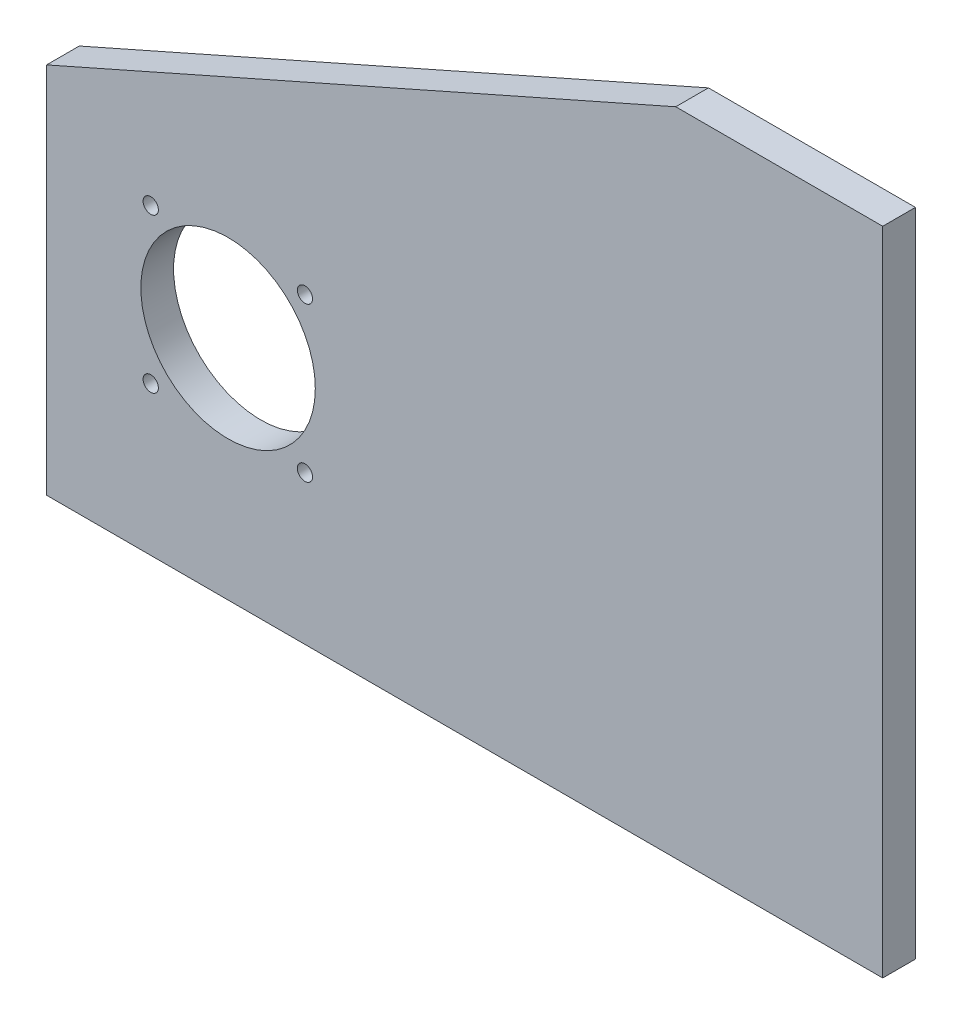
ISO-10303-21;
HEADER;
FILE_DESCRIPTION(('STEP AP214'),'2;1');
FILE_NAME('part.step','',(''),(''),'','','');
FILE_SCHEMA(('AUTOMOTIVE_DESIGN { 1 0 10303 214 1 1 1 1 }'));
ENDSEC;
DATA;
#1=APPLICATION_CONTEXT('core data for automotive mechanical design processes');
#2=APPLICATION_PROTOCOL_DEFINITION('international standard','automotive_design',2000,#1);
#3=PRODUCT_CONTEXT('',#1,'mechanical');
#4=PRODUCT('Part','Part','',(#3));
#5=PRODUCT_RELATED_PRODUCT_CATEGORY('part','',(#4));
#6=PRODUCT_DEFINITION_FORMATION('','',#4);
#7=PRODUCT_DEFINITION_CONTEXT('part definition',#1,'design');
#8=PRODUCT_DEFINITION('design','',#6,#7);
#9=PRODUCT_DEFINITION_SHAPE('','',#8);
#10=(LENGTH_UNIT() NAMED_UNIT(*) SI_UNIT(.MILLI.,.METRE.));
#11=(NAMED_UNIT(*) PLANE_ANGLE_UNIT() SI_UNIT($,.RADIAN.));
#12=(NAMED_UNIT(*) SI_UNIT($,.STERADIAN.) SOLID_ANGLE_UNIT());
#13=UNCERTAINTY_MEASURE_WITH_UNIT(LENGTH_MEASURE(1.E-05),#10,'distance_accuracy_value','');
#14=(GEOMETRIC_REPRESENTATION_CONTEXT(3) GLOBAL_UNCERTAINTY_ASSIGNED_CONTEXT((#13)) GLOBAL_UNIT_ASSIGNED_CONTEXT((#10,
#11,#12)) REPRESENTATION_CONTEXT('',''));
#15=CARTESIAN_POINT('',(0.,0.,0.));
#16=DIRECTION('',(0.,0.,1.));
#17=DIRECTION('',(1.,0.,0.));
#18=AXIS2_PLACEMENT_3D('',#15,#16,#17);
#19=CARTESIAN_POINT('',(-2757.22109900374,3423.79327060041,15.));
#20=DIRECTION('',(0.,0.,-1.));
#21=DIRECTION('',(-1.,0.,0.));
#22=AXIS2_PLACEMENT_3D('',#19,#20,#21);
#23=PLANE('',#22);
#24=CARTESIAN_POINT('',(-2638.72720889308,3562.73427177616,15.));
#25=DIRECTION('',(0.,0.,1.));
#26=DIRECTION('',(1.,0.,0.));
#27=AXIS2_PLACEMENT_3D('',#24,#25,#26);
#28=CIRCLE('',#27,3.47966760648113);
#29=CARTESIAN_POINT('',(-2635.2475412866,3562.73427177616,15.));
#30=VERTEX_POINT('',#29);
#31=EDGE_CURVE('E137',#30,#30,#28,.T.);
#32=ORIENTED_EDGE('',*,*,#31,.F.);
#33=EDGE_LOOP('',(#32));
#34=FACE_BOUND('',#33,.T.);
#35=CARTESIAN_POINT('',(-2709.45227002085,3492.0379825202,15.));
#36=DIRECTION('',(0.,0.,1.));
#37=DIRECTION('',(1.,0.,0.));
#38=AXIS2_PLACEMENT_3D('',#35,#36,#37);
#39=CIRCLE('',#38,3.49999999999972);
#40=CARTESIAN_POINT('',(-2705.95227002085,3492.0379825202,15.));
#41=VERTEX_POINT('',#40);
#42=EDGE_CURVE('E151',#41,#41,#39,.T.);
#43=ORIENTED_EDGE('',*,*,#42,.F.);
#44=EDGE_LOOP('',(#43));
#45=FACE_BOUND('',#44,.T.);
#46=DIRECTION('',(0.,-1.,0.));
#47=VECTOR('',#46,1.);
#48=CARTESIAN_POINT('',(-2757.22109900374,3594.69054767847,15.));
#49=LINE('',#48,#47);
#50=CARTESIAN_POINT('',(-2757.22109900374,3594.69054767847,15.));
#51=VERTEX_POINT('',#50);
#52=CARTESIAN_POINT('',(-2757.22109900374,3423.79327060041,15.));
#53=VERTEX_POINT('',#52);
#54=EDGE_CURVE('E102',#51,#53,#49,.T.);
#55=ORIENTED_EDGE('',*,*,#54,.T.);
#56=DIRECTION('',(1.,0.,0.));
#57=VECTOR('',#56,1.);
#58=CARTESIAN_POINT('',(-2499.88097263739,3423.79327060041,15.));
#59=LINE('',#58,#57);
#60=CARTESIAN_POINT('',(-2373.80172967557,3423.79327060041,15.));
#61=VERTEX_POINT('',#60);
#62=EDGE_CURVE('E85',#53,#61,#59,.T.);
#63=ORIENTED_EDGE('',*,*,#62,.T.);
#64=DIRECTION('',(0.,1.,0.));
#65=VECTOR('',#64,1.);
#66=CARTESIAN_POINT('',(-2373.80172967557,3423.79327060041,15.));
#67=LINE('',#66,#65);
#68=CARTESIAN_POINT('',(-2373.80172967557,3722.31649326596,15.));
#69=VERTEX_POINT('',#68);
#70=EDGE_CURVE('E105',#61,#69,#67,.T.);
#71=ORIENTED_EDGE('',*,*,#70,.T.);
#72=DIRECTION('',(-1.,0.,0.));
#73=VECTOR('',#72,1.);
#74=CARTESIAN_POINT('',(-2468.72011960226,3722.31649326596,15.));
#75=LINE('',#74,#73);
#76=CARTESIAN_POINT('',(-2468.72011960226,3722.31649326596,15.));
#77=VERTEX_POINT('',#76);
#78=EDGE_CURVE('E44',#69,#77,#75,.T.);
#79=ORIENTED_EDGE('',*,*,#78,.T.);
#80=DIRECTION('',(-0.914512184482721,-0.404558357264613,0.));
#81=VECTOR('',#80,1.);
#82=CARTESIAN_POINT('',(-2468.72011960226,3722.31649326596,15.));
#83=LINE('',#82,#81);
#84=EDGE_CURVE('E39',#77,#51,#83,.T.);
#85=ORIENTED_EDGE('',*,*,#84,.T.);
#86=EDGE_LOOP('',(#55,#63,#71,#79,#85));
#87=FACE_BOUND('',#86,.T.);
#88=CARTESIAN_POINT('',(-2673.98650882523,3527.7932706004,15.));
#89=DIRECTION('',(0.,0.,1.));
#90=DIRECTION('',(1.,0.,0.));
#91=AXIS2_PLACEMENT_3D('',#88,#89,#90);
#92=CIRCLE('',#91,39.9999999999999);
#93=CARTESIAN_POINT('',(-2633.98650882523,3527.7932706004,15.));
#94=VERTEX_POINT('',#93);
#95=EDGE_CURVE('E90',#94,#94,#92,.T.);
#96=ORIENTED_EDGE('',*,*,#95,.F.);
#97=EDGE_LOOP('',(#96));
#98=FACE_BOUND('',#97,.T.);
#99=CARTESIAN_POINT('',(-2709.45227002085,3562.74866063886,15.));
#100=DIRECTION('',(0.,0.,1.));
#101=DIRECTION('',(1.,0.,0.));
#102=AXIS2_PLACEMENT_3D('',#99,#100,#101);
#103=CIRCLE('',#102,3.50000000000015);
#104=CARTESIAN_POINT('',(-2705.95227002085,3562.74866063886,15.));
#105=VERTEX_POINT('',#104);
#106=EDGE_CURVE('E128',#105,#105,#103,.T.);
#107=ORIENTED_EDGE('',*,*,#106,.F.);
#108=EDGE_LOOP('',(#107));
#109=FACE_BOUND('',#108,.T.);
#110=CARTESIAN_POINT('',(-2638.7415919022,3492.0379825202,15.));
#111=DIRECTION('',(0.,0.,1.));
#112=DIRECTION('',(1.,0.,0.));
#113=AXIS2_PLACEMENT_3D('',#110,#111,#112);
#114=CIRCLE('',#113,3.49999999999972);
#115=CARTESIAN_POINT('',(-2635.2415919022,3492.0379825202,15.));
#116=VERTEX_POINT('',#115);
#117=EDGE_CURVE('E131',#116,#116,#114,.T.);
#118=ORIENTED_EDGE('',*,*,#117,.F.);
#119=EDGE_LOOP('',(#118));
#120=FACE_BOUND('',#119,.T.);
#121=ADVANCED_FACE('F24',(#34,#45,#87,#98,#109,#120),#23,.F.);
#122=CARTESIAN_POINT('',(-2757.22109900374,3423.79327060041,0.));
#123=DIRECTION('',(0.,0.,-1.));
#124=DIRECTION('',(-1.,0.,0.));
#125=AXIS2_PLACEMENT_3D('',#122,#123,#124);
#126=PLANE('',#125);
#127=CARTESIAN_POINT('',(-2638.72720889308,3562.73427177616,0.));
#128=DIRECTION('',(0.,0.,1.));
#129=DIRECTION('',(1.,0.,0.));
#130=AXIS2_PLACEMENT_3D('',#127,#128,#129);
#131=CIRCLE('',#130,3.47966760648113);
#132=CARTESIAN_POINT('',(-2635.2475412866,3562.73427177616,0.));
#133=VERTEX_POINT('',#132);
#134=EDGE_CURVE('E133',#133,#133,#131,.T.);
#135=ORIENTED_EDGE('',*,*,#134,.T.);
#136=EDGE_LOOP('',(#135));
#137=FACE_BOUND('',#136,.T.);
#138=CARTESIAN_POINT('',(-2709.45227002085,3492.0379825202,0.));
#139=DIRECTION('',(0.,0.,1.));
#140=DIRECTION('',(1.,0.,0.));
#141=AXIS2_PLACEMENT_3D('',#138,#139,#140);
#142=CIRCLE('',#141,3.49999999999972);
#143=CARTESIAN_POINT('',(-2705.95227002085,3492.0379825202,0.));
#144=VERTEX_POINT('',#143);
#145=EDGE_CURVE('E148',#144,#144,#142,.T.);
#146=ORIENTED_EDGE('',*,*,#145,.T.);
#147=EDGE_LOOP('',(#146));
#148=FACE_BOUND('',#147,.T.);
#149=DIRECTION('',(0.,-1.,0.));
#150=VECTOR('',#149,1.);
#151=CARTESIAN_POINT('',(-2757.22109900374,3594.69054767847,0.));
#152=LINE('',#151,#150);
#153=CARTESIAN_POINT('',(-2757.22109900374,3594.69054767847,0.));
#154=VERTEX_POINT('',#153);
#155=CARTESIAN_POINT('',(-2757.22109900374,3423.79327060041,0.));
#156=VERTEX_POINT('',#155);
#157=EDGE_CURVE('E76',#154,#156,#152,.T.);
#158=ORIENTED_EDGE('',*,*,#157,.F.);
#159=DIRECTION('',(-0.914512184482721,-0.404558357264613,0.));
#160=VECTOR('',#159,1.);
#161=CARTESIAN_POINT('',(-2468.72011960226,3722.31649326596,0.));
#162=LINE('',#161,#160);
#163=CARTESIAN_POINT('',(-2468.72011960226,3722.31649326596,0.));
#164=VERTEX_POINT('',#163);
#165=EDGE_CURVE('E100',#164,#154,#162,.T.);
#166=ORIENTED_EDGE('',*,*,#165,.F.);
#167=DIRECTION('',(-1.,0.,0.));
#168=VECTOR('',#167,1.);
#169=CARTESIAN_POINT('',(-2468.72011960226,3722.31649326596,0.));
#170=LINE('',#169,#168);
#171=CARTESIAN_POINT('',(-2373.80172967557,3722.31649326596,0.));
#172=VERTEX_POINT('',#171);
#173=EDGE_CURVE('E98',#172,#164,#170,.T.);
#174=ORIENTED_EDGE('',*,*,#173,.F.);
#175=DIRECTION('',(0.,1.,0.));
#176=VECTOR('',#175,1.);
#177=CARTESIAN_POINT('',(-2373.80172967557,3423.79327060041,0.));
#178=LINE('',#177,#176);
#179=CARTESIAN_POINT('',(-2373.80172967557,3423.79327060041,0.));
#180=VERTEX_POINT('',#179);
#181=EDGE_CURVE('E78',#180,#172,#178,.T.);
#182=ORIENTED_EDGE('',*,*,#181,.F.);
#183=DIRECTION('',(1.,0.,0.));
#184=VECTOR('',#183,1.);
#185=CARTESIAN_POINT('',(-2499.88097263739,3423.79327060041,0.));
#186=LINE('',#185,#184);
#187=EDGE_CURVE('E71',#156,#180,#186,.T.);
#188=ORIENTED_EDGE('',*,*,#187,.F.);
#189=EDGE_LOOP('',(#158,#166,#174,#182,#188));
#190=FACE_BOUND('',#189,.T.);
#191=CARTESIAN_POINT('',(-2673.98650882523,3527.7932706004,0.));
#192=DIRECTION('',(0.,0.,1.));
#193=DIRECTION('',(1.,0.,0.));
#194=AXIS2_PLACEMENT_3D('',#191,#192,#193);
#195=CIRCLE('',#194,39.9999999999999);
#196=CARTESIAN_POINT('',(-2633.98650882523,3527.7932706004,0.));
#197=VERTEX_POINT('',#196);
#198=EDGE_CURVE('E93',#197,#197,#195,.T.);
#199=ORIENTED_EDGE('',*,*,#198,.T.);
#200=EDGE_LOOP('',(#199));
#201=FACE_BOUND('',#200,.T.);
#202=CARTESIAN_POINT('',(-2709.45227002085,3562.74866063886,0.));
#203=DIRECTION('',(0.,0.,1.));
#204=DIRECTION('',(1.,0.,0.));
#205=AXIS2_PLACEMENT_3D('',#202,#203,#204);
#206=CIRCLE('',#205,3.50000000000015);
#207=CARTESIAN_POINT('',(-2705.95227002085,3562.74866063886,0.));
#208=VERTEX_POINT('',#207);
#209=EDGE_CURVE('E144',#208,#208,#206,.T.);
#210=ORIENTED_EDGE('',*,*,#209,.T.);
#211=EDGE_LOOP('',(#210));
#212=FACE_BOUND('',#211,.T.);
#213=CARTESIAN_POINT('',(-2638.7415919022,3492.0379825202,0.));
#214=DIRECTION('',(0.,0.,1.));
#215=DIRECTION('',(1.,0.,0.));
#216=AXIS2_PLACEMENT_3D('',#213,#214,#215);
#217=CIRCLE('',#216,3.49999999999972);
#218=CARTESIAN_POINT('',(-2635.2415919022,3492.0379825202,0.));
#219=VERTEX_POINT('',#218);
#220=EDGE_CURVE('E134',#219,#219,#217,.T.);
#221=ORIENTED_EDGE('',*,*,#220,.T.);
#222=EDGE_LOOP('',(#221));
#223=FACE_BOUND('',#222,.T.);
#224=ADVANCED_FACE('F72',(#137,#148,#190,#201,#212,#223),#126,.T.);
#225=CARTESIAN_POINT('',(-2757.22109900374,3594.69054767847,15.));
#226=DIRECTION('',(1.,0.,0.));
#227=DIRECTION('',(0.,0.,-1.));
#228=AXIS2_PLACEMENT_3D('',#225,#226,#227);
#229=PLANE('',#228);
#230=ORIENTED_EDGE('',*,*,#157,.T.);
#231=DIRECTION('',(0.,0.,-1.));
#232=VECTOR('',#231,1.);
#233=CARTESIAN_POINT('',(-2757.22109900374,3423.79327060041,15.));
#234=LINE('',#233,#232);
#235=EDGE_CURVE('E11',#53,#156,#234,.T.);
#236=ORIENTED_EDGE('',*,*,#235,.F.);
#237=ORIENTED_EDGE('',*,*,#54,.F.);
#238=DIRECTION('',(0.,0.,-1.));
#239=VECTOR('',#238,1.);
#240=CARTESIAN_POINT('',(-2757.22109900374,3594.69054767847,15.));
#241=LINE('',#240,#239);
#242=EDGE_CURVE('E89',#51,#154,#241,.T.);
#243=ORIENTED_EDGE('',*,*,#242,.T.);
#244=EDGE_LOOP('',(#230,#236,#237,#243));
#245=FACE_BOUND('',#244,.T.);
#246=ADVANCED_FACE('F26',(#245),#229,.F.);
#247=CARTESIAN_POINT('',(-2499.88097263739,3423.79327060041,15.));
#248=DIRECTION('',(0.,1.,0.));
#249=DIRECTION('',(0.,0.,1.));
#250=AXIS2_PLACEMENT_3D('',#247,#248,#249);
#251=PLANE('',#250);
#252=ORIENTED_EDGE('',*,*,#187,.T.);
#253=DIRECTION('',(0.,0.,-1.));
#254=VECTOR('',#253,1.);
#255=CARTESIAN_POINT('',(-2373.80172967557,3423.79327060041,15.));
#256=LINE('',#255,#254);
#257=EDGE_CURVE('E32',#61,#180,#256,.T.);
#258=ORIENTED_EDGE('',*,*,#257,.F.);
#259=ORIENTED_EDGE('',*,*,#62,.F.);
#260=ORIENTED_EDGE('',*,*,#235,.T.);
#261=EDGE_LOOP('',(#252,#258,#259,#260));
#262=FACE_BOUND('',#261,.T.);
#263=ADVANCED_FACE('F84',(#262),#251,.F.);
#264=CARTESIAN_POINT('',(-2373.80172967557,3423.79327060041,15.));
#265=DIRECTION('',(-1.,0.,0.));
#266=DIRECTION('',(0.,0.,1.));
#267=AXIS2_PLACEMENT_3D('',#264,#265,#266);
#268=PLANE('',#267);
#269=ORIENTED_EDGE('',*,*,#181,.T.);
#270=DIRECTION('',(0.,0.,-1.));
#271=VECTOR('',#270,1.);
#272=CARTESIAN_POINT('',(-2373.80172967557,3722.31649326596,15.));
#273=LINE('',#272,#271);
#274=EDGE_CURVE('E113',#69,#172,#273,.T.);
#275=ORIENTED_EDGE('',*,*,#274,.F.);
#276=ORIENTED_EDGE('',*,*,#70,.F.);
#277=ORIENTED_EDGE('',*,*,#257,.T.);
#278=EDGE_LOOP('',(#269,#275,#276,#277));
#279=FACE_BOUND('',#278,.T.);
#280=ADVANCED_FACE('F117',(#279),#268,.F.);
#281=CARTESIAN_POINT('',(-2468.72011960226,3722.31649326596,15.));
#282=DIRECTION('',(0.,-1.,0.));
#283=DIRECTION('',(0.,0.,-1.));
#284=AXIS2_PLACEMENT_3D('',#281,#282,#283);
#285=PLANE('',#284);
#286=ORIENTED_EDGE('',*,*,#173,.T.);
#287=DIRECTION('',(0.,0.,-1.));
#288=VECTOR('',#287,1.);
#289=CARTESIAN_POINT('',(-2468.72011960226,3722.31649326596,15.));
#290=LINE('',#289,#288);
#291=EDGE_CURVE('E110',#77,#164,#290,.T.);
#292=ORIENTED_EDGE('',*,*,#291,.F.);
#293=ORIENTED_EDGE('',*,*,#78,.F.);
#294=ORIENTED_EDGE('',*,*,#274,.T.);
#295=EDGE_LOOP('',(#286,#292,#293,#294));
#296=FACE_BOUND('',#295,.T.);
#297=ADVANCED_FACE('F170',(#296),#285,.F.);
#298=CARTESIAN_POINT('',(-2468.72011960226,3722.31649326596,15.));
#299=DIRECTION('',(0.404558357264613,-0.914512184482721,0.));
#300=DIRECTION('',(0.914512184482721,0.404558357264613,0.));
#301=AXIS2_PLACEMENT_3D('',#298,#299,#300);
#302=PLANE('',#301);
#303=ORIENTED_EDGE('',*,*,#165,.T.);
#304=ORIENTED_EDGE('',*,*,#242,.F.);
#305=ORIENTED_EDGE('',*,*,#84,.F.);
#306=ORIENTED_EDGE('',*,*,#291,.T.);
#307=EDGE_LOOP('',(#303,#304,#305,#306));
#308=FACE_BOUND('',#307,.T.);
#309=ADVANCED_FACE('F160',(#308),#302,.F.);
#310=CARTESIAN_POINT('',(-2673.98650882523,3527.7932706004,15.));
#311=DIRECTION('',(0.,0.,-1.));
#312=DIRECTION('',(-1.,0.,0.));
#313=AXIS2_PLACEMENT_3D('',#310,#311,#312);
#314=CYLINDRICAL_SURFACE('',#313,39.9999999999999);
#315=ORIENTED_EDGE('',*,*,#95,.T.);
#316=EDGE_LOOP('',(#315));
#317=FACE_BOUND('',#316,.T.);
#318=ORIENTED_EDGE('',*,*,#198,.F.);
#319=EDGE_LOOP('',(#318));
#320=FACE_BOUND('',#319,.T.);
#321=ADVANCED_FACE('F157',(#317,#320),#314,.F.);
#322=CARTESIAN_POINT('',(-2709.45227002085,3492.0379825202,15.));
#323=DIRECTION('',(0.,0.,-1.));
#324=DIRECTION('',(-1.,0.,0.));
#325=AXIS2_PLACEMENT_3D('',#322,#323,#324);
#326=CYLINDRICAL_SURFACE('',#325,3.49999999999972);
#327=ORIENTED_EDGE('',*,*,#42,.T.);
#328=EDGE_LOOP('',(#327));
#329=FACE_BOUND('',#328,.T.);
#330=ORIENTED_EDGE('',*,*,#145,.F.);
#331=EDGE_LOOP('',(#330));
#332=FACE_BOUND('',#331,.T.);
#333=ADVANCED_FACE('F159',(#329,#332),#326,.F.);
#334=CARTESIAN_POINT('',(-2709.45227002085,3562.74866063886,15.));
#335=DIRECTION('',(0.,0.,-1.));
#336=DIRECTION('',(-1.,0.,0.));
#337=AXIS2_PLACEMENT_3D('',#334,#335,#336);
#338=CYLINDRICAL_SURFACE('',#337,3.50000000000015);
#339=ORIENTED_EDGE('',*,*,#106,.T.);
#340=EDGE_LOOP('',(#339));
#341=FACE_BOUND('',#340,.T.);
#342=ORIENTED_EDGE('',*,*,#209,.F.);
#343=EDGE_LOOP('',(#342));
#344=FACE_BOUND('',#343,.T.);
#345=ADVANCED_FACE('F167',(#341,#344),#338,.F.);
#346=CARTESIAN_POINT('',(-2638.72720889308,3562.73427177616,15.));
#347=DIRECTION('',(0.,0.,-1.));
#348=DIRECTION('',(-1.,0.,0.));
#349=AXIS2_PLACEMENT_3D('',#346,#347,#348);
#350=CYLINDRICAL_SURFACE('',#349,3.47966760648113);
#351=ORIENTED_EDGE('',*,*,#31,.T.);
#352=EDGE_LOOP('',(#351));
#353=FACE_BOUND('',#352,.T.);
#354=ORIENTED_EDGE('',*,*,#134,.F.);
#355=EDGE_LOOP('',(#354));
#356=FACE_BOUND('',#355,.T.);
#357=ADVANCED_FACE('F226',(#353,#356),#350,.F.);
#358=CARTESIAN_POINT('',(-2638.7415919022,3492.0379825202,15.));
#359=DIRECTION('',(0.,0.,-1.));
#360=DIRECTION('',(-1.,0.,0.));
#361=AXIS2_PLACEMENT_3D('',#358,#359,#360);
#362=CYLINDRICAL_SURFACE('',#361,3.49999999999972);
#363=ORIENTED_EDGE('',*,*,#117,.T.);
#364=EDGE_LOOP('',(#363));
#365=FACE_BOUND('',#364,.T.);
#366=ORIENTED_EDGE('',*,*,#220,.F.);
#367=EDGE_LOOP('',(#366));
#368=FACE_BOUND('',#367,.T.);
#369=ADVANCED_FACE('F233',(#365,#368),#362,.F.);
#370=CLOSED_SHELL('',(#121,#224,#246,#263,#280,#297,#309,#321,#333,#345,#357,#369));
#371=MANIFOLD_SOLID_BREP('B2',#370);
#372=ADVANCED_BREP_SHAPE_REPRESENTATION('',(#18,#371),#14);
#373=SHAPE_DEFINITION_REPRESENTATION(#9,#372);
ENDSEC;
END-ISO-10303-21;
